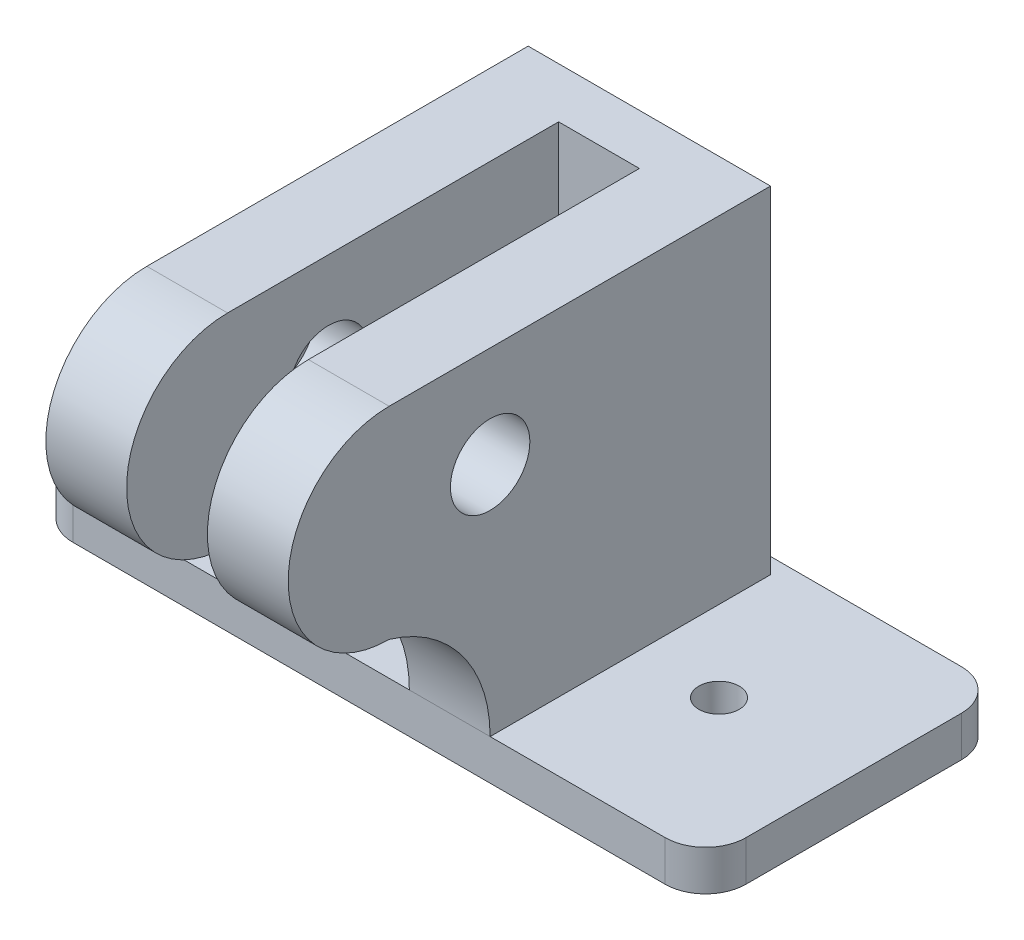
from build123d import *

# Parameters (mm, degrees)
SKETCH1_W            = 50
SKETCH1_H            = 22
BOSS_EXTRUDE1_DEPTH  = 3
BOSS_EXTRUDE2_DEPTH  = 25
SKETCH7_W            = 6
SKETCH7_H            = 25
BOSS_EXTRUDE18_DEPTH = 15
CUT_EXTRUDE6_DEPTH   = 18
SKETCH9_R            = 1.45
CUT_EXTRUDE7_DEPTH   = 18
SKETCH10_R           = 2.95
CUT_EXTRUDE8_DEPTH   = 16
FILLET1_R            = 3
SKETCH11_R           = 1.5
CUT_EXTRUDE9_DEPTH   = 16


with BuildPart() as part:
    # Sketch1 → Boss-Extrude1 (new body)
    with BuildSketch(Plane(origin=(0, 0, 0), x_dir=(1, 0, 0), z_dir=(0, 1, 0))):
        Rectangle(SKETCH1_W, SKETCH1_H)
    extrude(amount=BOSS_EXTRUDE1_DEPTH)

    # Sketch2 → Boss-Extrude2 (add)
    with BuildSketch(Plane(origin=(0, 3, 0), x_dir=(1, 0, 0), z_dir=(0, 1, 0))):
        Polygon((0, 6.086359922), (3, 6.086359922), (3, -9.148207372), (3, -11), (9, -11), (9, -9.148207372), (9, 9.824904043), (-9, 9.824904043), (-9, -9.148207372), (-9, -11), (-3, -11), (-3, -9.148207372), (-3, 6.086359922), align=None)
    extrude(amount=BOSS_EXTRUDE2_DEPTH)

    # Sketch7 → Boss-Extrude18 (add)
    with BuildSketch(Plane.XY.offset(11)):
        with Locations((-6, 15.5)):
            Rectangle(SKETCH7_W, SKETCH7_H)
        with Locations((6, 15.5)):
            Rectangle(SKETCH7_W, SKETCH7_H)
    extrude(amount=BOSS_EXTRUDE18_DEPTH)

    # Sketch8 → Cut-Extrude6 (cut)
    with BuildSketch(Plane(origin=(9, 0, 0), x_dir=(0, 0, -1), z_dir=(1, 0, 0))):
        with BuildLine():
            Line((-26, 3), (-11, 3))
            ThreePointArc((-11, 3), (-13.083333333, 9.25), (-18.5, 13))
            ThreePointArc((-18.5, 13), (-23.803300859, 15.196699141), (-26, 20.5))
            Line((-26, 20.5), (-26, 3))
        make_face()
        with BuildLine():
            ThreePointArc((-26, 20.5), (-23.803300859, 25.803300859), (-18.5, 28))
            Line((-18.5, 28), (-26, 28))
            Line((-26, 28), (-26, 20.5))
        make_face()
    extrude(amount=-CUT_EXTRUDE6_DEPTH, mode=Mode.SUBTRACT)

    # Sketch9 → Cut-Extrude7 (cut)
    with BuildSketch(Plane(origin=(9, 0, 0), x_dir=(0, 0, -1), z_dir=(1, 0, 0))):
        with Locations((-11, 20.5)):
            Circle(SKETCH9_R)
    extrude(amount=-CUT_EXTRUDE7_DEPTH, mode=Mode.SUBTRACT)

    # Sketch10 → Cut-Extrude8 (cut)
    with BuildSketch(Plane(origin=(9, 0, 0), x_dir=(0, 0, -1), z_dir=(1, 0, 0))):
        with Locations((-11, 20.5)):
            Circle(SKETCH10_R)
    extrude(amount=-CUT_EXTRUDE8_DEPTH, mode=Mode.SUBTRACT)

    # Fillet1
    fillet1_edges = [part.edges().sort_by_distance(p)[0] for p in [
        (25, 1.5, 11),
        (-25, 1.5, 11),
        (-25, 1.5, -11),
        (25, 1.5, -11),
    ]]
    fillet(fillet1_edges, radius=FILLET1_R)

    # Sketch11 → Cut-Extrude9 (cut)
    with BuildSketch(Plane(origin=(0, 3, 0), x_dir=(1, 0, 0), z_dir=(0, 1, 0))):
        with Locations(Location((-15, 0, 0), (0, 0, 270))):
            Circle(SKETCH11_R)
        with Locations(Location((15, 0, 0), (0, 0, 270))):
            Circle(SKETCH11_R)
    extrude(amount=-CUT_EXTRUDE9_DEPTH, mode=Mode.SUBTRACT)


solid = part.part
